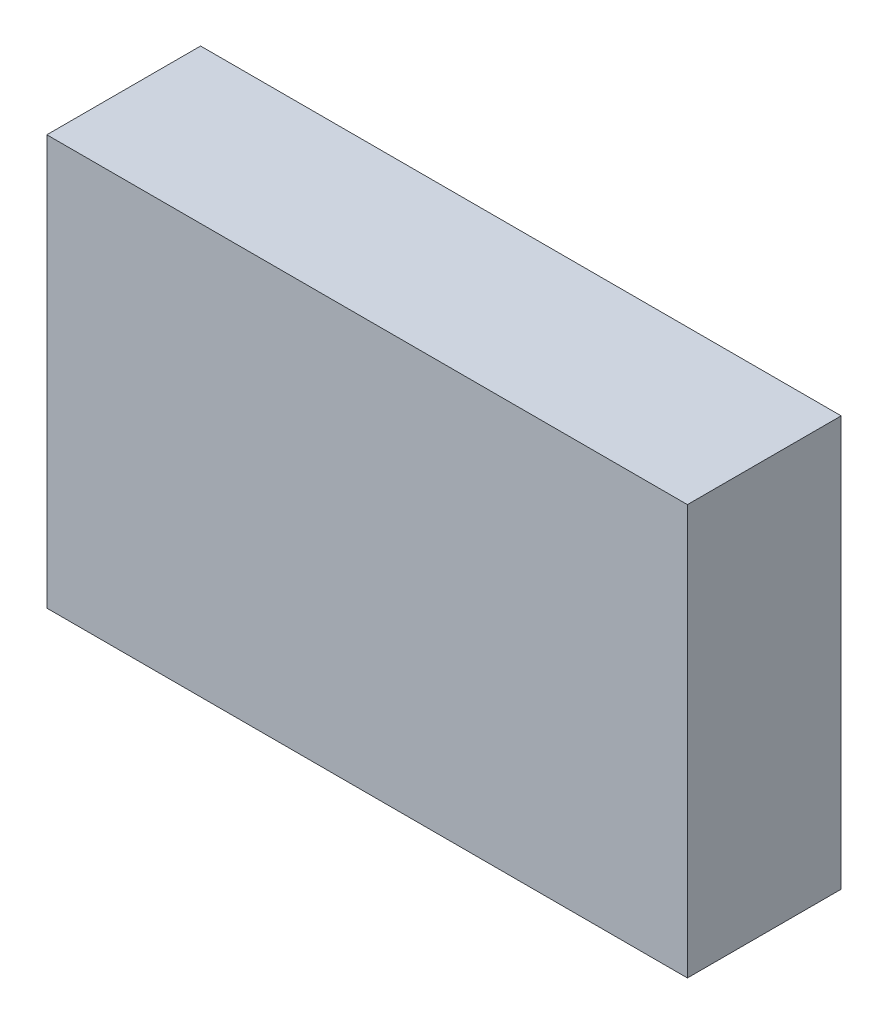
ISO-10303-21;
HEADER;
FILE_DESCRIPTION(('STEP AP214'),'2;1');
FILE_NAME('part.step','',(''),(''),'','','');
FILE_SCHEMA(('AUTOMOTIVE_DESIGN { 1 0 10303 214 1 1 1 1 }'));
ENDSEC;
DATA;
#1=APPLICATION_CONTEXT('core data for automotive mechanical design processes');
#2=APPLICATION_PROTOCOL_DEFINITION('international standard','automotive_design',2000,#1);
#3=PRODUCT_CONTEXT('',#1,'mechanical');
#4=PRODUCT('Part','Part','',(#3));
#5=PRODUCT_RELATED_PRODUCT_CATEGORY('part','',(#4));
#6=PRODUCT_DEFINITION_FORMATION('','',#4);
#7=PRODUCT_DEFINITION_CONTEXT('part definition',#1,'design');
#8=PRODUCT_DEFINITION('design','',#6,#7);
#9=PRODUCT_DEFINITION_SHAPE('','',#8);
#10=(LENGTH_UNIT() NAMED_UNIT(*) SI_UNIT(.MILLI.,.METRE.));
#11=(NAMED_UNIT(*) PLANE_ANGLE_UNIT() SI_UNIT($,.RADIAN.));
#12=(NAMED_UNIT(*) SI_UNIT($,.STERADIAN.) SOLID_ANGLE_UNIT());
#13=UNCERTAINTY_MEASURE_WITH_UNIT(LENGTH_MEASURE(1.E-05),#10,'distance_accuracy_value','');
#14=(GEOMETRIC_REPRESENTATION_CONTEXT(3) GLOBAL_UNCERTAINTY_ASSIGNED_CONTEXT((#13)) GLOBAL_UNIT_ASSIGNED_CONTEXT((#10,
#11,#12)) REPRESENTATION_CONTEXT('',''));
#15=CARTESIAN_POINT('',(0.,0.,0.));
#16=DIRECTION('',(0.,0.,1.));
#17=DIRECTION('',(1.,0.,0.));
#18=AXIS2_PLACEMENT_3D('',#15,#16,#17);
#19=CARTESIAN_POINT('',(-2.50000021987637,1.59999912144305,0.));
#20=DIRECTION('',(-8.74227765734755E-08,0.999999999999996,0.));
#21=DIRECTION('',(0.999999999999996,8.74227765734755E-08,0.));
#22=AXIS2_PLACEMENT_3D('',#19,#20,#21);
#23=PLANE('',#22);
#24=DIRECTION('',(0.,0.,1.));
#25=VECTOR('',#24,1.);
#26=CARTESIAN_POINT('',(-2.50000021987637,1.59999912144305,0.));
#27=LINE('',#26,#25);
#28=CARTESIAN_POINT('',(-2.50000021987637,1.59999912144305,0.));
#29=VERTEX_POINT('',#28);
#30=CARTESIAN_POINT('',(-2.50000021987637,1.59999912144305,1.20000014));
#31=VERTEX_POINT('',#30);
#32=EDGE_CURVE('E11',#29,#31,#27,.T.);
#33=ORIENTED_EDGE('',*,*,#32,.T.);
#34=DIRECTION('',(0.999999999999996,8.74227765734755E-08,0.));
#35=VECTOR('',#34,1.);
#36=CARTESIAN_POINT('',(-2.50000021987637,1.59999912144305,1.20000014));
#37=LINE('',#36,#35);
#38=CARTESIAN_POINT('',(2.49999994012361,1.59999955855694,1.20000014));
#39=VERTEX_POINT('',#38);
#40=EDGE_CURVE('E24',#31,#39,#37,.T.);
#41=ORIENTED_EDGE('',*,*,#40,.T.);
#42=DIRECTION('',(0.,0.,1.));
#43=VECTOR('',#42,1.);
#44=CARTESIAN_POINT('',(2.49999994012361,1.59999955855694,0.));
#45=LINE('',#44,#43);
#46=CARTESIAN_POINT('',(2.49999994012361,1.59999955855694,0.));
#47=VERTEX_POINT('',#46);
#48=EDGE_CURVE('E85',#47,#39,#45,.T.);
#49=ORIENTED_EDGE('',*,*,#48,.F.);
#50=DIRECTION('',(0.999999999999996,8.74227765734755E-08,0.));
#51=VECTOR('',#50,1.);
#52=CARTESIAN_POINT('',(-2.50000021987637,1.59999912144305,0.));
#53=LINE('',#52,#51);
#54=EDGE_CURVE('E83',#29,#47,#53,.T.);
#55=ORIENTED_EDGE('',*,*,#54,.F.);
#56=EDGE_LOOP('',(#33,#41,#49,#55));
#57=FACE_BOUND('',#56,.T.);
#58=ADVANCED_FACE('F17',(#57),#23,.T.);
#59=CARTESIAN_POINT('',(2.49999994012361,1.59999955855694,0.));
#60=DIRECTION('',(0.999999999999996,8.74227765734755E-08,0.));
#61=DIRECTION('',(8.74227765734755E-08,-0.999999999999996,0.));
#62=AXIS2_PLACEMENT_3D('',#59,#60,#61);
#63=PLANE('',#62);
#64=ORIENTED_EDGE('',*,*,#48,.T.);
#65=DIRECTION('',(8.74227765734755E-08,-0.999999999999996,0.));
#66=VECTOR('',#65,1.);
#67=CARTESIAN_POINT('',(2.49999994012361,1.59999955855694,1.20000014));
#68=LINE('',#67,#66);
#69=CARTESIAN_POINT('',(2.50000021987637,-1.59999912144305,1.20000014));
#70=VERTEX_POINT('',#69);
#71=EDGE_CURVE('E81',#39,#70,#68,.T.);
#72=ORIENTED_EDGE('',*,*,#71,.T.);
#73=DIRECTION('',(0.,0.,1.));
#74=VECTOR('',#73,1.);
#75=CARTESIAN_POINT('',(2.50000021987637,-1.59999912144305,0.));
#76=LINE('',#75,#74);
#77=CARTESIAN_POINT('',(2.50000021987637,-1.59999912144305,0.));
#78=VERTEX_POINT('',#77);
#79=EDGE_CURVE('E79',#78,#70,#76,.T.);
#80=ORIENTED_EDGE('',*,*,#79,.F.);
#81=DIRECTION('',(8.74227765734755E-08,-0.999999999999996,0.));
#82=VECTOR('',#81,1.);
#83=CARTESIAN_POINT('',(2.49999994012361,1.59999955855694,0.));
#84=LINE('',#83,#82);
#85=EDGE_CURVE('E69',#47,#78,#84,.T.);
#86=ORIENTED_EDGE('',*,*,#85,.F.);
#87=EDGE_LOOP('',(#64,#72,#80,#86));
#88=FACE_BOUND('',#87,.T.);
#89=ADVANCED_FACE('F90',(#88),#63,.T.);
#90=CARTESIAN_POINT('',(2.50000021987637,-1.59999912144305,0.));
#91=DIRECTION('',(8.74227765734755E-08,-0.999999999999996,0.));
#92=DIRECTION('',(-0.999999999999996,-8.74227765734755E-08,0.));
#93=AXIS2_PLACEMENT_3D('',#90,#91,#92);
#94=PLANE('',#93);
#95=ORIENTED_EDGE('',*,*,#79,.T.);
#96=DIRECTION('',(-0.999999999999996,-8.74227765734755E-08,0.));
#97=VECTOR('',#96,1.);
#98=CARTESIAN_POINT('',(2.50000021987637,-1.59999912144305,1.20000014));
#99=LINE('',#98,#97);
#100=CARTESIAN_POINT('',(-2.49999994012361,-1.59999955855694,1.20000014));
#101=VERTEX_POINT('',#100);
#102=EDGE_CURVE('E60',#70,#101,#99,.T.);
#103=ORIENTED_EDGE('',*,*,#102,.T.);
#104=DIRECTION('',(0.,0.,1.));
#105=VECTOR('',#104,1.);
#106=CARTESIAN_POINT('',(-2.49999994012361,-1.59999955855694,0.));
#107=LINE('',#106,#105);
#108=CARTESIAN_POINT('',(-2.49999994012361,-1.59999955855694,0.));
#109=VERTEX_POINT('',#108);
#110=EDGE_CURVE('E54',#109,#101,#107,.T.);
#111=ORIENTED_EDGE('',*,*,#110,.F.);
#112=DIRECTION('',(-0.999999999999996,-8.74227765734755E-08,0.));
#113=VECTOR('',#112,1.);
#114=CARTESIAN_POINT('',(2.50000021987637,-1.59999912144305,0.));
#115=LINE('',#114,#113);
#116=EDGE_CURVE('E58',#78,#109,#115,.T.);
#117=ORIENTED_EDGE('',*,*,#116,.F.);
#118=EDGE_LOOP('',(#95,#103,#111,#117));
#119=FACE_BOUND('',#118,.T.);
#120=ADVANCED_FACE('F57',(#119),#94,.T.);
#121=CARTESIAN_POINT('',(-2.49999994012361,-1.59999955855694,0.));
#122=DIRECTION('',(-0.999999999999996,-8.74227765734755E-08,0.));
#123=DIRECTION('',(-8.74227765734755E-08,0.999999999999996,0.));
#124=AXIS2_PLACEMENT_3D('',#121,#122,#123);
#125=PLANE('',#124);
#126=ORIENTED_EDGE('',*,*,#110,.T.);
#127=DIRECTION('',(-8.74227765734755E-08,0.999999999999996,0.));
#128=VECTOR('',#127,1.);
#129=CARTESIAN_POINT('',(-2.49999994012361,-1.59999955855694,1.20000014));
#130=LINE('',#129,#128);
#131=EDGE_CURVE('E71',#101,#31,#130,.T.);
#132=ORIENTED_EDGE('',*,*,#131,.T.);
#133=ORIENTED_EDGE('',*,*,#32,.F.);
#134=DIRECTION('',(-8.74227765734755E-08,0.999999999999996,0.));
#135=VECTOR('',#134,1.);
#136=CARTESIAN_POINT('',(-2.49999994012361,-1.59999955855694,0.));
#137=LINE('',#136,#135);
#138=EDGE_CURVE('E67',#109,#29,#137,.T.);
#139=ORIENTED_EDGE('',*,*,#138,.F.);
#140=EDGE_LOOP('',(#126,#132,#133,#139));
#141=FACE_BOUND('',#140,.T.);
#142=ADVANCED_FACE('F73',(#141),#125,.T.);
#143=CARTESIAN_POINT('',(-2.50000021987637,1.59999912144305,0.));
#144=DIRECTION('',(0.,0.,1.));
#145=DIRECTION('',(-0.999999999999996,-8.74227765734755E-08,0.));
#146=AXIS2_PLACEMENT_3D('',#143,#144,#145);
#147=PLANE('',#146);
#148=ORIENTED_EDGE('',*,*,#54,.T.);
#149=ORIENTED_EDGE('',*,*,#85,.T.);
#150=ORIENTED_EDGE('',*,*,#116,.T.);
#151=ORIENTED_EDGE('',*,*,#138,.T.);
#152=EDGE_LOOP('',(#148,#149,#150,#151));
#153=FACE_BOUND('',#152,.T.);
#154=ADVANCED_FACE('F66',(#153),#147,.F.);
#155=CARTESIAN_POINT('',(-2.50000021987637,1.59999912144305,1.20000014));
#156=DIRECTION('',(0.,0.,1.));
#157=DIRECTION('',(-0.999999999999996,-8.74227765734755E-08,0.));
#158=AXIS2_PLACEMENT_3D('',#155,#156,#157);
#159=PLANE('',#158);
#160=ORIENTED_EDGE('',*,*,#131,.F.);
#161=ORIENTED_EDGE('',*,*,#102,.F.);
#162=ORIENTED_EDGE('',*,*,#71,.F.);
#163=ORIENTED_EDGE('',*,*,#40,.F.);
#164=EDGE_LOOP('',(#160,#161,#162,#163));
#165=FACE_BOUND('',#164,.T.);
#166=ADVANCED_FACE('F91',(#165),#159,.T.);
#167=CLOSED_SHELL('',(#58,#89,#120,#142,#154,#166));
#168=MANIFOLD_SOLID_BREP('B1',#167);
#169=ADVANCED_BREP_SHAPE_REPRESENTATION('',(#18,#168),#14);
#170=SHAPE_DEFINITION_REPRESENTATION(#9,#169);
ENDSEC;
END-ISO-10303-21;
